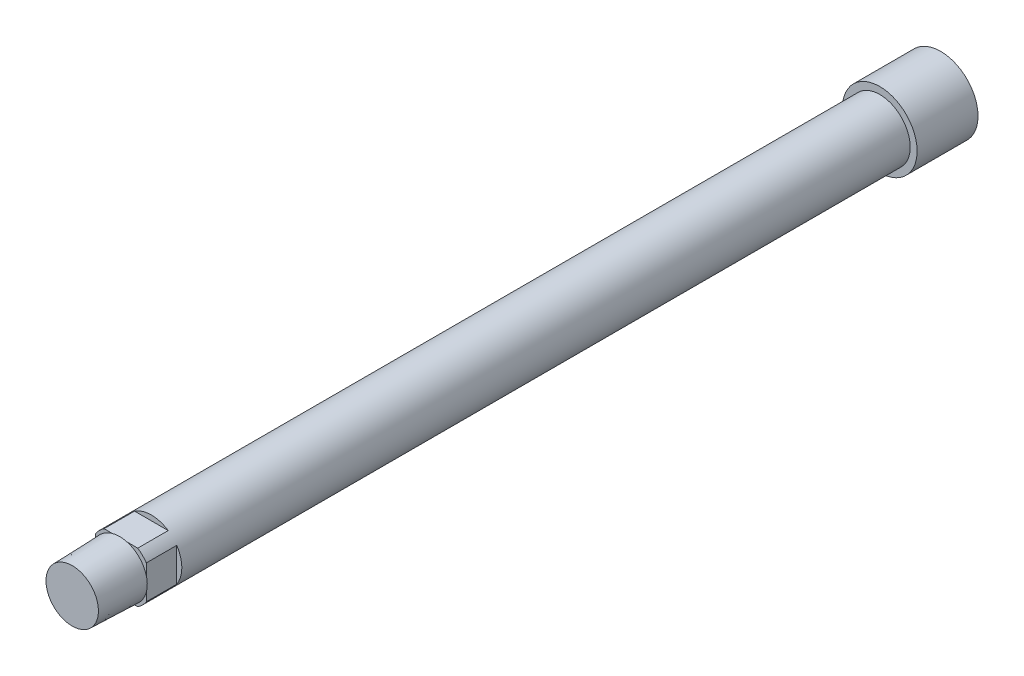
from build123d import *

# Parameters (mm, degrees)
SKETCH1_R          = 9.525
SKETCH1_R_2        = 6.35
BASE_EXTRUDE_DEPTH = 252.6284
SKETCH8_R          = 7.62
CUT_EXTRUDE4_DEPTH = 7.62
SKETCH11_R         = 12.7
SKETCH11_W         = 15.875
SKETCH11_H         = 15.875
CUT_EXTRUDE5_DEPTH = 9.525
SKETCH14_R         = 11.684
WEB_EXTRUDE1_DEPTH = 19.05


with BuildPart() as part:
    # Sketch1 → Base-Extrude (new body)
    with BuildSketch(Plane.XY):
        Circle(SKETCH1_R)
        Circle(SKETCH1_R_2, mode=Mode.SUBTRACT)
    extrude(amount=BASE_EXTRUDE_DEPTH)

    # Sketch8 → Cut-Extrude4 (cut)
    with BuildSketch(Plane(origin=(0, 0, 0), x_dir=(-1, 0, 0), z_dir=(0, 0, -1))):
        Circle(SKETCH8_R)
    extrude(amount=-CUT_EXTRUDE4_DEPTH, mode=Mode.SUBTRACT)

    # Sketch9 → Cut-Revolve1 (revolve, cut)
    with BuildSketch(Plane(origin=(0, 0, 0), x_dir=(0, 0, -1), z_dir=(1, 0, 0)), mode=Mode.PRIVATE) as cut_revolve1_sk:
        Polygon((-252.6284, 7.2136), (-251.9934, 8.350933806), (-251.3584, 7.253067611), (-250.7234, 8.390401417), (-250.0884, 7.292535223), (-249.4534, 8.429869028), (-248.8184, 7.332002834), (-248.1834, 8.469336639), (-247.5484, 7.371470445), (-246.9134, 8.508804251), (-246.2784, 7.410938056), (-245.6434, 8.548271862), (-245.0084, 7.450405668), (-244.3734, 8.587739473), (-243.7384, 7.489873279), (-243.1034, 8.627207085), (-242.4684, 7.52934089), (-241.8334, 8.666674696), (-241.1984, 7.568808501), (-240.5634, 8.706142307), (-239.9284, 7.608276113), (-239.2934, 8.745609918), (-238.6584, 7.647743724), (-238.0234, 8.78507753), (-237.3884, 7.687211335), (-237.3884, 9.525), (-252.6284, 9.525), align=None)
    revolve(cut_revolve1_sk.sketch.rotate(Axis((0, 0, 252.6284), (0, 0, -1)), 180), axis=Axis((0, 0, 252.6284), (0, 0, -1)), mode=Mode.SUBTRACT)

    # Sketch10 → Cut-Revolve2 (revolve, cut)
    with BuildSketch(Plane(origin=(0, 0, 0), x_dir=(0, 0, -1), z_dir=(1, 0, 0)), mode=Mode.PRIVATE) as cut_revolve2_sk:
        Polygon((-252.6284, 9.525), (-237.3884, 9.525), (-237.3884, 8.5725), (-240.775165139, 8.5725), (-252.6284, 8.204138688), align=None)
    revolve(cut_revolve2_sk.sketch.rotate(Axis((0, 0, 252.6284), (0, 0, -1)), 180), axis=Axis((0, 0, 252.6284), (0, 0, -1)), mode=Mode.SUBTRACT)

    # Sketch11 → Cut-Extrude5 (cut)
    with BuildSketch(Plane.XY.offset(237.3884)):
        Circle(SKETCH11_R)
        Rectangle(SKETCH11_W, SKETCH11_H, mode=Mode.SUBTRACT)
    extrude(amount=-CUT_EXTRUDE5_DEPTH, mode=Mode.SUBTRACT)

    # Sketch13 → WEB Revolve1 (revolve)
    with BuildSketch(Plane(origin=(0, 0, 0), x_dir=(0, 0, -1), z_dir=(1, 0, 0)), mode=Mode.PRIVATE) as web_revolve1_sk:
        Polygon((-252.6284, 8.204138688), (-237.808996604, 8.664679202), (-236.470198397, 6.35), (-7.62, 6.35), (-7.62, 7.62), (0, 7.62), (0, 0), (-252.6284, 0), align=None)
    revolve(web_revolve1_sk.sketch.rotate(Axis((0, 0, 105.319919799), (0, 0, -1)), 180), axis=Axis((0, 0, 105.319919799), (0, 0, -1)))

    # Sketch14 → WEB Extrude1 (add)
    with BuildSketch(Plane(origin=(0, 0, 0), x_dir=(-1, 0, 0), z_dir=(0, 0, -1))):
        with Locations(Location((0, 0, 0), (0, 0, 180))):
            Circle(SKETCH14_R)
    extrude(amount=WEB_EXTRUDE1_DEPTH)


solid = part.part
